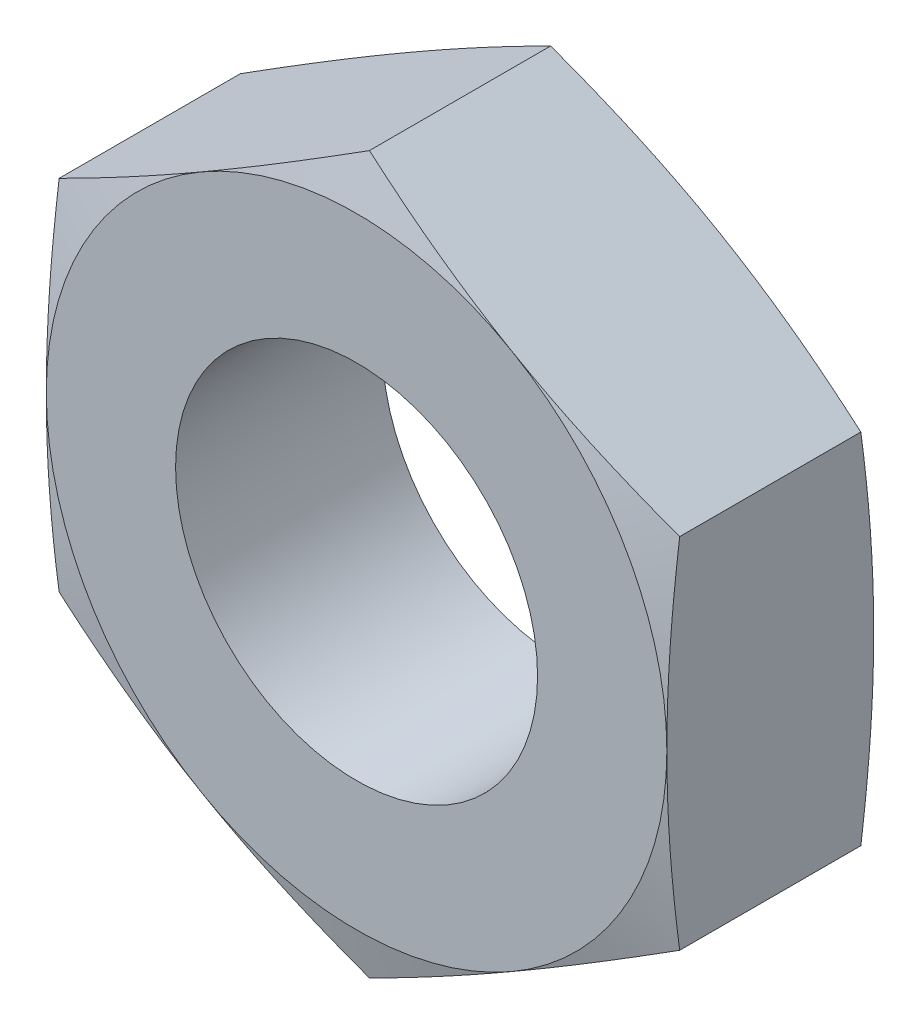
ISO-10303-21;
HEADER;
FILE_DESCRIPTION(('STEP AP214'),'2;1');
FILE_NAME('part.step','',(''),(''),'','','');
FILE_SCHEMA(('AUTOMOTIVE_DESIGN { 1 0 10303 214 1 1 1 1 }'));
ENDSEC;
DATA;
#1=APPLICATION_CONTEXT('core data for automotive mechanical design processes');
#2=APPLICATION_PROTOCOL_DEFINITION('international standard','automotive_design',2000,#1);
#3=PRODUCT_CONTEXT('',#1,'mechanical');
#4=PRODUCT('Part','Part','',(#3));
#5=PRODUCT_RELATED_PRODUCT_CATEGORY('part','',(#4));
#6=PRODUCT_DEFINITION_FORMATION('','',#4);
#7=PRODUCT_DEFINITION_CONTEXT('part definition',#1,'design');
#8=PRODUCT_DEFINITION('design','',#6,#7);
#9=PRODUCT_DEFINITION_SHAPE('','',#8);
#10=(LENGTH_UNIT() NAMED_UNIT(*) SI_UNIT(.MILLI.,.METRE.));
#11=(NAMED_UNIT(*) PLANE_ANGLE_UNIT() SI_UNIT($,.RADIAN.));
#12=(NAMED_UNIT(*) SI_UNIT($,.STERADIAN.) SOLID_ANGLE_UNIT());
#13=UNCERTAINTY_MEASURE_WITH_UNIT(LENGTH_MEASURE(1.E-05),#10,'distance_accuracy_value','');
#14=(GEOMETRIC_REPRESENTATION_CONTEXT(3) GLOBAL_UNCERTAINTY_ASSIGNED_CONTEXT((#13)) GLOBAL_UNIT_ASSIGNED_CONTEXT((#10,
#11,#12)) REPRESENTATION_CONTEXT('',''));
#15=CARTESIAN_POINT('',(0.,0.,0.));
#16=DIRECTION('',(0.,0.,1.));
#17=DIRECTION('',(1.,0.,0.));
#18=AXIS2_PLACEMENT_3D('',#15,#16,#17);
#19=CARTESIAN_POINT('',(0.,17.3205080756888,10.));
#20=DIRECTION('',(0.5,-0.866025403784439,0.));
#21=DIRECTION('',(0.866025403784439,0.5,0.));
#22=AXIS2_PLACEMENT_3D('',#19,#20,#21);
#23=PLANE('',#22);
#24=CARTESIAN_POINT('',(-15.0002,8.66013856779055,0.621809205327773));
#25=CARTESIAN_POINT('',(-14.3772710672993,9.01978675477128,0.525403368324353));
#26=CARTESIAN_POINT('',(-13.7532127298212,9.38008700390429,0.437882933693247));
#27=CARTESIAN_POINT('',(-12.5028922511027,10.1019598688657,0.284117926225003));
#28=CARTESIAN_POINT('',(-11.8766293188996,10.4635329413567,0.217881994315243));
#29=CARTESIAN_POINT('',(-10.6256964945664,11.1857593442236,0.110552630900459));
#30=CARTESIAN_POINT('',(-10.0010350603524,11.5464077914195,0.0693312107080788));
#31=CARTESIAN_POINT('',(-8.7509156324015,12.2681645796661,0.0140575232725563));
#32=CARTESIAN_POINT('',(-8.12545781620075,12.6292728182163,0.));
#33=CARTESIAN_POINT('',(-6.87454218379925,13.3514892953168,0.));
#34=CARTESIAN_POINT('',(-6.2490843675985,13.7125975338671,0.0140575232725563));
#35=CARTESIAN_POINT('',(-4.99896493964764,14.4343543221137,0.069331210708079));
#36=CARTESIAN_POINT('',(-4.37430350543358,14.7950027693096,0.110552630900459));
#37=CARTESIAN_POINT('',(-3.12337068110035,15.5172291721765,0.217881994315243));
#38=CARTESIAN_POINT('',(-2.49710774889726,15.8788022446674,0.284117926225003));
#39=CARTESIAN_POINT('',(-1.24678727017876,16.6006751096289,0.437882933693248));
#40=CARTESIAN_POINT('',(-0.622728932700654,16.9609753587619,0.525403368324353));
#41=CARTESIAN_POINT('',(0.000200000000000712,17.3206235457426,0.621809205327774));
#42=B_SPLINE_CURVE_WITH_KNOTS('',3,(#24,#25,#26,#27,#28,#29,#30,#31,#32,#33,#34,#35,#36,#37,#38,
#39,#40,#41),.UNSPECIFIED.,.F.,.F.,(4,2,2,2,2,2,2,2,4),(0.,2.17729853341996,4.35547987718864,
6.52242029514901,8.68894138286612,10.8554624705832,13.0224028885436,15.2005842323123,
17.3778827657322),.UNSPECIFIED.);
#43=CARTESIAN_POINT('',(-15.,8.66025403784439,0.621778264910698));
#44=VERTEX_POINT('',#43);
#45=CARTESIAN_POINT('',(-7.5,12.9903810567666,0.));
#46=VERTEX_POINT('',#45);
#47=EDGE_CURVE('E125',#44,#46,#42,.T.);
#48=ORIENTED_EDGE('',*,*,#47,.F.);
#49=DIRECTION('',(0.,0.,-1.));
#50=VECTOR('',#49,1.);
#51=CARTESIAN_POINT('',(-15.,8.66025403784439,10.));
#52=LINE('',#51,#50);
#53=CARTESIAN_POINT('',(-15.,8.66025403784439,9.3782217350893));
#54=VERTEX_POINT('',#53);
#55=EDGE_CURVE('E212',#54,#44,#52,.T.);
#56=ORIENTED_EDGE('',*,*,#55,.F.);
#57=CARTESIAN_POINT('',(0.000200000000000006,17.3206235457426,9.37819079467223));
#58=CARTESIAN_POINT('',(-0.622728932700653,16.9609753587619,9.47459663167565));
#59=CARTESIAN_POINT('',(-1.24678727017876,16.6006751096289,9.56211706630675));
#60=CARTESIAN_POINT('',(-2.49710774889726,15.8788022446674,9.715882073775));
#61=CARTESIAN_POINT('',(-3.12337068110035,15.5172291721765,9.78211800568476));
#62=CARTESIAN_POINT('',(-4.37430350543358,14.7950027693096,9.88944736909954));
#63=CARTESIAN_POINT('',(-4.99896493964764,14.4343543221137,9.93066878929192));
#64=CARTESIAN_POINT('',(-6.2490843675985,13.7125975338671,9.98594247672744));
#65=CARTESIAN_POINT('',(-6.87454218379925,13.3514892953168,10.));
#66=CARTESIAN_POINT('',(-8.12545781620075,12.6292728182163,10.));
#67=CARTESIAN_POINT('',(-8.7509156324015,12.2681645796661,9.98594247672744));
#68=CARTESIAN_POINT('',(-10.0010350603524,11.5464077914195,9.93066878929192));
#69=CARTESIAN_POINT('',(-10.6256964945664,11.1857593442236,9.88944736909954));
#70=CARTESIAN_POINT('',(-11.8766293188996,10.4635329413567,9.78211800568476));
#71=CARTESIAN_POINT('',(-12.5028922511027,10.1019598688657,9.715882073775));
#72=CARTESIAN_POINT('',(-13.7532127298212,9.38008700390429,9.56211706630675));
#73=CARTESIAN_POINT('',(-14.3772710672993,9.01978675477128,9.47459663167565));
#74=CARTESIAN_POINT('',(-15.0002,8.66013856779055,9.37819079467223));
#75=B_SPLINE_CURVE_WITH_KNOTS('',3,(#57,#58,#59,#60,#61,#62,#63,#64,#65,#66,#67,#68,#69,#70,#71,
#72,#73,#74),.UNSPECIFIED.,.F.,.F.,(4,2,2,2,2,2,2,2,4),(0.,2.17729853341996,4.35547987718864,
6.52242029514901,8.68894138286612,10.8554624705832,13.0224028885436,15.2005842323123,
17.3778827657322),.UNSPECIFIED.);
#76=CARTESIAN_POINT('',(-7.5,12.9903810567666,10.));
#77=VERTEX_POINT('',#76);
#78=EDGE_CURVE('E234',#77,#54,#75,.T.);
#79=ORIENTED_EDGE('',*,*,#78,.F.);
#80=CARTESIAN_POINT('',(0.,17.3205080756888,9.3782217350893));
#81=VERTEX_POINT('',#80);
#82=EDGE_CURVE('E231',#81,#77,#75,.T.);
#83=ORIENTED_EDGE('',*,*,#82,.F.);
#84=DIRECTION('',(0.,0.,-1.));
#85=VECTOR('',#84,1.);
#86=CARTESIAN_POINT('',(0.,17.3205080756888,10.));
#87=LINE('',#86,#85);
#88=CARTESIAN_POINT('',(0.,17.3205080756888,0.621778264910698));
#89=VERTEX_POINT('',#88);
#90=EDGE_CURVE('E151',#81,#89,#87,.T.);
#91=ORIENTED_EDGE('',*,*,#90,.T.);
#92=EDGE_CURVE('E134',#46,#89,#42,.T.);
#93=ORIENTED_EDGE('',*,*,#92,.F.);
#94=EDGE_LOOP('',(#48,#56,#79,#83,#91,#93));
#95=FACE_BOUND('',#94,.T.);
#96=ADVANCED_FACE('F38',(#95),#23,.F.);
#97=CARTESIAN_POINT('',(-15.,8.66025403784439,10.));
#98=DIRECTION('',(1.,0.,0.));
#99=DIRECTION('',(0.,0.,-1.));
#100=AXIS2_PLACEMENT_3D('',#97,#98,#99);
#101=PLANE('',#100);
#102=CARTESIAN_POINT('',(-15.,-23.2131682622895,3.38630377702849));
#103=CARTESIAN_POINT('',(-15.,-22.5288374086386,3.23233440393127));
#104=CARTESIAN_POINT('',(-15.,-21.8440866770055,3.08019861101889));
#105=CARTESIAN_POINT('',(-15.,-20.4735384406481,2.78058502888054));
#106=CARTESIAN_POINT('',(-15.,-19.7877408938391,2.63310743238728));
#107=CARTESIAN_POINT('',(-15.,-18.4143353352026,2.34368475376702));
#108=CARTESIAN_POINT('',(-15.,-17.7267262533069,2.20174473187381));
#109=CARTESIAN_POINT('',(-15.,-16.3500980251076,1.92487925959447));
#110=CARTESIAN_POINT('',(-15.,-15.6610788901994,1.78995375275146));
#111=CARTESIAN_POINT('',(-15.,-14.2874577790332,1.52994537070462));
#112=CARTESIAN_POINT('',(-15.,-13.6028702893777,1.40478632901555));
#113=CARTESIAN_POINT('',(-15.,-12.2318286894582,1.165061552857));
#114=CARTESIAN_POINT('',(-15.,-11.5453745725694,1.05049585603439));
#115=CARTESIAN_POINT('',(-15.,-10.170443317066,0.834474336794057));
#116=CARTESIAN_POINT('',(-15.,-9.4819663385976,0.733017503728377));
#117=CARTESIAN_POINT('',(-15.,-8.10281343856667,0.546146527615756));
#118=CARTESIAN_POINT('',(-15.,-7.41213751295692,0.460732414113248));
#119=CARTESIAN_POINT('',(-15.,-6.02060687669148,0.308288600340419));
#120=CARTESIAN_POINT('',(-15.,-5.31972713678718,0.241484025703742));
#121=CARTESIAN_POINT('',(-15.,-3.91614186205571,0.130833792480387));
#122=CARTESIAN_POINT('',(-15.,-3.21343636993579,0.0869876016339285));
#123=CARTESIAN_POINT('',(-15.,-1.80725202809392,0.0248063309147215));
#124=CARTESIAN_POINT('',(-15.,-1.10377379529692,0.0064575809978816));
#125=CARTESIAN_POINT('',(-15.,0.30337547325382,-0.00359711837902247));
#126=CARTESIAN_POINT('',(-15.,1.00704650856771,0.00469687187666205));
#127=CARTESIAN_POINT('',(-15.,2.41670242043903,0.0474823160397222));
#128=CARTESIAN_POINT('',(-15.,3.12268369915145,0.0820899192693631));
#129=CARTESIAN_POINT('',(-15.,4.53302706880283,0.175523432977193));
#130=CARTESIAN_POINT('',(-15.,5.23738912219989,0.234349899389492));
#131=CARTESIAN_POINT('',(-15.,6.64451201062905,0.37317514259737));
#132=CARTESIAN_POINT('',(-15.,7.34727129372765,0.453189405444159));
#133=CARTESIAN_POINT('',(-15.,8.75050977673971,0.630966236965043));
#134=CARTESIAN_POINT('',(-15.,9.45098898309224,0.728728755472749));
#135=CARTESIAN_POINT('',(-15.,10.9675253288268,0.956457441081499));
#136=CARTESIAN_POINT('',(-15.,11.7831812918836,1.08907429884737));
#137=CARTESIAN_POINT('',(-15.,13.411851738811,1.36973252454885));
#138=CARTESIAN_POINT('',(-15.,14.2248660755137,1.51777473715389));
#139=CARTESIAN_POINT('',(-15.,15.8487741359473,1.82583201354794));
#140=CARTESIAN_POINT('',(-15.,16.6596674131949,1.98584941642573));
#141=CARTESIAN_POINT('',(-15.,18.2795427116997,2.31515959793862));
#142=CARTESIAN_POINT('',(-15.,19.0885247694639,2.48445219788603));
#143=CARTESIAN_POINT('',(-15.,20.7053727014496,2.83039275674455));
#144=CARTESIAN_POINT('',(-15.,21.5132377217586,3.0070446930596));
#145=CARTESIAN_POINT('',(-15.,23.1276900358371,3.3660924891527));
#146=CARTESIAN_POINT('',(-15.,23.9342773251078,3.54848836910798));
#147=CARTESIAN_POINT('',(-15.,25.5463044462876,3.91784583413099));
#148=CARTESIAN_POINT('',(-15.,26.3517444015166,4.10480688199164));
#149=CARTESIAN_POINT('',(-15.,27.9617531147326,4.48243252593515));
#150=CARTESIAN_POINT('',(-15.,28.7663218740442,4.67309711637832));
#151=CARTESIAN_POINT('',(-15.,30.363210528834,5.05469435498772));
#152=CARTESIAN_POINT('',(-15.,31.1555407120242,5.24558399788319));
#153=CARTESIAN_POINT('',(-15.,32.7396116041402,5.62979499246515));
#154=CARTESIAN_POINT('',(-15.,33.5313523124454,5.82311634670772));
#155=CARTESIAN_POINT('',(-15.,35.9058840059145,6.4061164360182));
#156=CARTESIAN_POINT('',(-15.,37.4879325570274,6.79881871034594));
#157=CARTESIAN_POINT('',(-15.,40.6477168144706,7.58923608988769));
#158=CARTESIAN_POINT('',(-15.,42.2254551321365,7.98694078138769));
#159=CARTESIAN_POINT('',(-15.,44.5912213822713,8.58666010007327));
#160=CARTESIAN_POINT('',(-15.,45.3796518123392,8.78708894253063));
#161=CARTESIAN_POINT('',(-15.,46.9562764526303,9.18887107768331));
#162=CARTESIAN_POINT('',(-15.,47.7444706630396,9.39022436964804));
#163=CARTESIAN_POINT('',(-15.,48.5325634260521,9.59197373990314));
#164=B_SPLINE_CURVE_WITH_KNOTS('',3,(#102,#103,#104,#105,#106,#107,#108,#109,#110,#111,#112,
#113,#114,#115,#116,#117,#118,#119,#120,#121,#122,#123,#124,#125,#126,#127,#128,#129,#130,#131,
#132,#133,#134,#135,#136,#137,#138,#139,#140,#141,#142,#143,#144,#145,#146,#147,#148,#149,#150,
#151,#152,#153,#154,#155,#156,#157,#158,#159,#160,#161,#162,#163),.UNSPECIFIED.,.F.,.F.,(4,2,2,
2,2,2,2,2,2,2,2,2,2,2,2,2,2,2,2,2,2,2,2,2,2,2,2,2,2,2,4),(0.,2.10432223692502,4.20873142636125,
6.31502061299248,8.42129284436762,10.5090298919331,12.5967743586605,14.6843577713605,
16.7719450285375,18.8837865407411,20.9955790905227,23.106238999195,25.2168941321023,
27.3369202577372,29.4569950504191,31.5786236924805,33.700246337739,36.1791488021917,
38.6581870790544,41.1377108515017,43.617186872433,46.0980207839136,48.5788634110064,
51.0594154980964,53.5399638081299,55.9849609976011,58.429960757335,63.320120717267,
68.2013885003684,70.641910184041,73.0824299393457),.UNSPECIFIED.);
#165=CARTESIAN_POINT('',(-15.,-8.66025403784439,0.621778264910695));
#166=VERTEX_POINT('',#165);
#167=CARTESIAN_POINT('',(-15.,0.,0.));
#168=VERTEX_POINT('',#167);
#169=EDGE_CURVE('E261',#166,#168,#164,.T.);
#170=ORIENTED_EDGE('',*,*,#169,.F.);
#171=DIRECTION('',(0.,0.,-1.));
#172=VECTOR('',#171,1.);
#173=CARTESIAN_POINT('',(-15.,-8.66025403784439,10.));
#174=LINE('',#173,#172);
#175=CARTESIAN_POINT('',(-15.,-8.66025403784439,9.3782217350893));
#176=VERTEX_POINT('',#175);
#177=EDGE_CURVE('E214',#176,#166,#174,.T.);
#178=ORIENTED_EDGE('',*,*,#177,.F.);
#179=CARTESIAN_POINT('',(-15.,-23.2131682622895,6.61369622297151));
#180=CARTESIAN_POINT('',(-15.,-22.5288374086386,6.76766559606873));
#181=CARTESIAN_POINT('',(-15.,-21.8440866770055,6.9198013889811));
#182=CARTESIAN_POINT('',(-15.,-20.4735384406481,7.21941497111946));
#183=CARTESIAN_POINT('',(-15.,-19.7877408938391,7.36689256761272));
#184=CARTESIAN_POINT('',(-15.,-18.4143353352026,7.65631524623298));
#185=CARTESIAN_POINT('',(-15.,-17.7267262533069,7.79825526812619));
#186=CARTESIAN_POINT('',(-15.,-16.3500980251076,8.07512074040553));
#187=CARTESIAN_POINT('',(-15.,-15.6610788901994,8.21004624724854));
#188=CARTESIAN_POINT('',(-15.,-14.2874577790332,8.47005462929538));
#189=CARTESIAN_POINT('',(-15.,-13.6028702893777,8.59521367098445));
#190=CARTESIAN_POINT('',(-15.,-12.2318286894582,8.834938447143));
#191=CARTESIAN_POINT('',(-15.,-11.5453745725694,8.94950414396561));
#192=CARTESIAN_POINT('',(-15.,-10.170443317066,9.16552566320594));
#193=CARTESIAN_POINT('',(-15.,-9.48196633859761,9.26698249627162));
#194=CARTESIAN_POINT('',(-15.,-8.10281343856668,9.45385347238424));
#195=CARTESIAN_POINT('',(-15.,-7.41213751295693,9.53926758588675));
#196=CARTESIAN_POINT('',(-15.,-6.02060687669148,9.69171139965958));
#197=CARTESIAN_POINT('',(-15.,-5.31972713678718,9.75851597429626));
#198=CARTESIAN_POINT('',(-15.,-3.9161418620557,9.86916620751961));
#199=CARTESIAN_POINT('',(-15.,-3.21343636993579,9.91301239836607));
#200=CARTESIAN_POINT('',(-15.,-1.80725202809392,9.97519366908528));
#201=CARTESIAN_POINT('',(-15.,-1.10377379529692,9.99354241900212));
#202=CARTESIAN_POINT('',(-15.,0.303375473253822,10.003597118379));
#203=CARTESIAN_POINT('',(-15.,1.00704650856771,9.99530312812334));
#204=CARTESIAN_POINT('',(-15.,2.41670242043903,9.95251768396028));
#205=CARTESIAN_POINT('',(-15.,3.12268369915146,9.91791008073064));
#206=CARTESIAN_POINT('',(-15.,4.53302706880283,9.82447656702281));
#207=CARTESIAN_POINT('',(-15.,5.23738912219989,9.76565010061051));
#208=CARTESIAN_POINT('',(-15.,6.64451201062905,9.62682485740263));
#209=CARTESIAN_POINT('',(-15.,7.34727129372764,9.54681059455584));
#210=CARTESIAN_POINT('',(-15.,8.75050977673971,9.36903376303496));
#211=CARTESIAN_POINT('',(-15.,9.45098898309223,9.27127124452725));
#212=CARTESIAN_POINT('',(-15.,10.9675253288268,9.0435425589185));
#213=CARTESIAN_POINT('',(-15.,11.7831812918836,8.91092570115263));
#214=CARTESIAN_POINT('',(-15.,13.411851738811,8.63026747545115));
#215=CARTESIAN_POINT('',(-15.,14.2248660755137,8.48222526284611));
#216=CARTESIAN_POINT('',(-15.,15.8487741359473,8.17416798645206));
#217=CARTESIAN_POINT('',(-15.,16.6596674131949,8.01415058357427));
#218=CARTESIAN_POINT('',(-15.,18.2795427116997,7.68484040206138));
#219=CARTESIAN_POINT('',(-15.,19.0885247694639,7.51554780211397));
#220=CARTESIAN_POINT('',(-15.,20.7053727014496,7.16960724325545));
#221=CARTESIAN_POINT('',(-15.,21.5132377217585,6.9929553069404));
#222=CARTESIAN_POINT('',(-15.,23.127690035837,6.63390751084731));
#223=CARTESIAN_POINT('',(-15.,23.9342773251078,6.45151163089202));
#224=CARTESIAN_POINT('',(-15.,25.5463044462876,6.08215416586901));
#225=CARTESIAN_POINT('',(-15.,26.3517444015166,5.89519311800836));
#226=CARTESIAN_POINT('',(-15.,27.9617531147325,5.51756747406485));
#227=CARTESIAN_POINT('',(-15.,28.7663218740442,5.32690288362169));
#228=CARTESIAN_POINT('',(-15.,30.363210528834,4.94530564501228));
#229=CARTESIAN_POINT('',(-15.,31.1555407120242,4.75441600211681));
#230=CARTESIAN_POINT('',(-15.,32.7396116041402,4.37020500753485));
#231=CARTESIAN_POINT('',(-15.,33.5313523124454,4.17688365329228));
#232=CARTESIAN_POINT('',(-15.,35.9058840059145,3.5938835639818));
#233=CARTESIAN_POINT('',(-15.,37.4879325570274,3.20118128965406));
#234=CARTESIAN_POINT('',(-15.,40.6477168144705,2.41076391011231));
#235=CARTESIAN_POINT('',(-15.,42.2254551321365,2.01305921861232));
#236=CARTESIAN_POINT('',(-15.,44.5912213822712,1.41333989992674));
#237=CARTESIAN_POINT('',(-15.,45.3796518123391,1.21291105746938));
#238=CARTESIAN_POINT('',(-15.,46.9562764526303,0.8111289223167));
#239=CARTESIAN_POINT('',(-15.,47.7444706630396,0.609775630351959));
#240=CARTESIAN_POINT('',(-15.,48.5325634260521,0.408026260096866));
#241=B_SPLINE_CURVE_WITH_KNOTS('',3,(#179,#180,#181,#182,#183,#184,#185,#186,#187,#188,#189,
#190,#191,#192,#193,#194,#195,#196,#197,#198,#199,#200,#201,#202,#203,#204,#205,#206,#207,#208,
#209,#210,#211,#212,#213,#214,#215,#216,#217,#218,#219,#220,#221,#222,#223,#224,#225,#226,#227,
#228,#229,#230,#231,#232,#233,#234,#235,#236,#237,#238,#239,#240),.UNSPECIFIED.,.F.,.F.,(4,2,2,
2,2,2,2,2,2,2,2,2,2,2,2,2,2,2,2,2,2,2,2,2,2,2,2,2,2,2,4),(0.,2.10432223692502,4.20873142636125,
6.31502061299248,8.42129284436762,10.5090298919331,12.5967743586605,14.6843577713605,
16.7719450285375,18.8837865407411,20.9955790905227,23.106238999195,25.2168941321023,
27.3369202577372,29.4569950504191,31.5786236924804,33.700246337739,36.1791488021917,
38.6581870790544,41.1377108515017,43.617186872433,46.0980207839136,48.5788634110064,
51.0594154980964,53.5399638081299,55.9849609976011,58.429960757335,63.320120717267,
68.2013885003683,70.6419101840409,73.0824299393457),.UNSPECIFIED.);
#242=CARTESIAN_POINT('',(-15.,0.,10.));
#243=VERTEX_POINT('',#242);
#244=EDGE_CURVE('E240',#243,#176,#241,.F.);
#245=ORIENTED_EDGE('',*,*,#244,.F.);
#246=EDGE_CURVE('E239',#54,#243,#241,.F.);
#247=ORIENTED_EDGE('',*,*,#246,.F.);
#248=ORIENTED_EDGE('',*,*,#55,.T.);
#249=EDGE_CURVE('E128',#168,#44,#164,.T.);
#250=ORIENTED_EDGE('',*,*,#249,.F.);
#251=EDGE_LOOP('',(#170,#178,#245,#247,#248,#250));
#252=FACE_BOUND('',#251,.T.);
#253=ADVANCED_FACE('F251',(#252),#101,.F.);
#254=CARTESIAN_POINT('',(0.,-17.3205080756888,10.));
#255=DIRECTION('',(0.5,0.866025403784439,0.));
#256=DIRECTION('',(-0.866025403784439,0.5,0.));
#257=AXIS2_PLACEMENT_3D('',#254,#255,#256);
#258=PLANE('',#257);
#259=CARTESIAN_POINT('',(0.000200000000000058,-17.3206235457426,0.621809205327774));
#260=CARTESIAN_POINT('',(-0.622728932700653,-16.9609753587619,0.525403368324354));
#261=CARTESIAN_POINT('',(-1.24678727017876,-16.6006751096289,0.437882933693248));
#262=CARTESIAN_POINT('',(-2.49710774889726,-15.8788022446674,0.284117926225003));
#263=CARTESIAN_POINT('',(-3.12337068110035,-15.5172291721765,0.217881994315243));
#264=CARTESIAN_POINT('',(-4.37430350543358,-14.7950027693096,0.11055263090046));
#265=CARTESIAN_POINT('',(-4.99896493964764,-14.4343543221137,0.0693312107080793));
#266=CARTESIAN_POINT('',(-6.2490843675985,-13.7125975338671,0.0140575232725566));
#267=CARTESIAN_POINT('',(-6.87454218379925,-13.3514892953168,0.));
#268=CARTESIAN_POINT('',(-8.12545781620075,-12.6292728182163,0.));
#269=CARTESIAN_POINT('',(-8.7509156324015,-12.2681645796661,0.0140575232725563));
#270=CARTESIAN_POINT('',(-10.0010350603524,-11.5464077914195,0.0693312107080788));
#271=CARTESIAN_POINT('',(-10.6256964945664,-11.1857593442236,0.110552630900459));
#272=CARTESIAN_POINT('',(-11.8766293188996,-10.4635329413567,0.217881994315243));
#273=CARTESIAN_POINT('',(-12.5028922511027,-10.1019598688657,0.284117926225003));
#274=CARTESIAN_POINT('',(-13.7532127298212,-9.38008700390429,0.437882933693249));
#275=CARTESIAN_POINT('',(-14.3772710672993,-9.01978675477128,0.525403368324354));
#276=CARTESIAN_POINT('',(-15.0002,-8.66013856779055,0.621809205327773));
#277=B_SPLINE_CURVE_WITH_KNOTS('',3,(#259,#260,#261,#262,#263,#264,#265,#266,#267,#268,#269,
#270,#271,#272,#273,#274,#275,#276),.UNSPECIFIED.,.F.,.F.,(4,2,2,2,2,2,2,2,4),(0.,
2.17729853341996,4.35547987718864,6.52242029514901,8.68894138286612,10.8554624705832,
13.0224028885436,15.2005842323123,17.3778827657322),.UNSPECIFIED.);
#278=CARTESIAN_POINT('',(0.,-17.3205080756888,0.621778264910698));
#279=VERTEX_POINT('',#278);
#280=CARTESIAN_POINT('',(-7.5,-12.9903810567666,0.));
#281=VERTEX_POINT('',#280);
#282=EDGE_CURVE('E269',#279,#281,#277,.T.);
#283=ORIENTED_EDGE('',*,*,#282,.F.);
#284=DIRECTION('',(0.,0.,-1.));
#285=VECTOR('',#284,1.);
#286=CARTESIAN_POINT('',(0.,-17.3205080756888,10.));
#287=LINE('',#286,#285);
#288=CARTESIAN_POINT('',(0.,-17.3205080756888,9.3782217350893));
#289=VERTEX_POINT('',#288);
#290=EDGE_CURVE('E217',#289,#279,#287,.T.);
#291=ORIENTED_EDGE('',*,*,#290,.F.);
#292=CARTESIAN_POINT('',(-15.0002,-8.66013856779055,9.37819079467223));
#293=CARTESIAN_POINT('',(-14.3772710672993,-9.01978675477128,9.47459663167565));
#294=CARTESIAN_POINT('',(-13.7532127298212,-9.38008700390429,9.56211706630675));
#295=CARTESIAN_POINT('',(-12.5028922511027,-10.1019598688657,9.715882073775));
#296=CARTESIAN_POINT('',(-11.8766293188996,-10.4635329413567,9.78211800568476));
#297=CARTESIAN_POINT('',(-10.6256964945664,-11.1857593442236,9.88944736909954));
#298=CARTESIAN_POINT('',(-10.0010350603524,-11.5464077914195,9.93066878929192));
#299=CARTESIAN_POINT('',(-8.7509156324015,-12.2681645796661,9.98594247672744));
#300=CARTESIAN_POINT('',(-8.12545781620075,-12.6292728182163,10.));
#301=CARTESIAN_POINT('',(-6.87454218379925,-13.3514892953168,10.));
#302=CARTESIAN_POINT('',(-6.2490843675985,-13.7125975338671,9.98594247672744));
#303=CARTESIAN_POINT('',(-4.99896493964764,-14.4343543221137,9.93066878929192));
#304=CARTESIAN_POINT('',(-4.37430350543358,-14.7950027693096,9.88944736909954));
#305=CARTESIAN_POINT('',(-3.12337068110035,-15.5172291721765,9.78211800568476));
#306=CARTESIAN_POINT('',(-2.49710774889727,-15.8788022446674,9.715882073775));
#307=CARTESIAN_POINT('',(-1.24678727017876,-16.6006751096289,9.56211706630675));
#308=CARTESIAN_POINT('',(-0.622728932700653,-16.9609753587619,9.47459663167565));
#309=CARTESIAN_POINT('',(0.000200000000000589,-17.3206235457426,9.37819079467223));
#310=B_SPLINE_CURVE_WITH_KNOTS('',3,(#292,#293,#294,#295,#296,#297,#298,#299,#300,#301,#302,
#303,#304,#305,#306,#307,#308,#309),.UNSPECIFIED.,.F.,.F.,(4,2,2,2,2,2,2,2,4),(0.,
2.17729853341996,4.35547987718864,6.52242029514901,8.68894138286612,10.8554624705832,
13.0224028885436,15.2005842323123,17.3778827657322),.UNSPECIFIED.);
#311=CARTESIAN_POINT('',(-7.5,-12.9903810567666,10.));
#312=VERTEX_POINT('',#311);
#313=EDGE_CURVE('E246',#312,#289,#310,.T.);
#314=ORIENTED_EDGE('',*,*,#313,.F.);
#315=EDGE_CURVE('E245',#176,#312,#310,.T.);
#316=ORIENTED_EDGE('',*,*,#315,.F.);
#317=ORIENTED_EDGE('',*,*,#177,.T.);
#318=EDGE_CURVE('E184',#281,#166,#277,.T.);
#319=ORIENTED_EDGE('',*,*,#318,.F.);
#320=EDGE_LOOP('',(#283,#291,#314,#316,#317,#319));
#321=FACE_BOUND('',#320,.T.);
#322=ADVANCED_FACE('F254',(#321),#258,.F.);
#323=CARTESIAN_POINT('',(0.,-17.3205080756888,10.));
#324=DIRECTION('',(-0.5,0.866025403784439,0.));
#325=DIRECTION('',(-0.866025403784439,-0.5,0.));
#326=AXIS2_PLACEMENT_3D('',#323,#324,#325);
#327=PLANE('',#326);
#328=CARTESIAN_POINT('',(15.0002,-8.66013856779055,0.621809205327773));
#329=CARTESIAN_POINT('',(14.3772710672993,-9.01978675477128,0.525403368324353));
#330=CARTESIAN_POINT('',(13.7532127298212,-9.38008700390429,0.437882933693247));
#331=CARTESIAN_POINT('',(12.5028922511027,-10.1019598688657,0.284117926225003));
#332=CARTESIAN_POINT('',(11.8766293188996,-10.4635329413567,0.217881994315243));
#333=CARTESIAN_POINT('',(10.6256964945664,-11.1857593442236,0.110552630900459));
#334=CARTESIAN_POINT('',(10.0010350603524,-11.5464077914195,0.0693312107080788));
#335=CARTESIAN_POINT('',(8.7509156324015,-12.2681645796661,0.0140575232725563));
#336=CARTESIAN_POINT('',(8.12545781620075,-12.6292728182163,0.));
#337=CARTESIAN_POINT('',(6.87454218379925,-13.3514892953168,0.));
#338=CARTESIAN_POINT('',(6.2490843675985,-13.7125975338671,0.0140575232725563));
#339=CARTESIAN_POINT('',(4.99896493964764,-14.4343543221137,0.069331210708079));
#340=CARTESIAN_POINT('',(4.37430350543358,-14.7950027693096,0.110552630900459));
#341=CARTESIAN_POINT('',(3.12337068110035,-15.5172291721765,0.217881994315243));
#342=CARTESIAN_POINT('',(2.49710774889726,-15.8788022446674,0.284117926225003));
#343=CARTESIAN_POINT('',(1.24678727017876,-16.6006751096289,0.437882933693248));
#344=CARTESIAN_POINT('',(0.622728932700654,-16.9609753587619,0.525403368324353));
#345=CARTESIAN_POINT('',(-0.000200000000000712,-17.3206235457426,0.621809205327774));
#346=B_SPLINE_CURVE_WITH_KNOTS('',3,(#328,#329,#330,#331,#332,#333,#334,#335,#336,#337,#338,
#339,#340,#341,#342,#343,#344,#345),.UNSPECIFIED.,.F.,.F.,(4,2,2,2,2,2,2,2,4),(0.,
2.17729853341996,4.35547987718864,6.52242029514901,8.68894138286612,10.8554624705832,
13.0224028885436,15.2005842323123,17.3778827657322),.UNSPECIFIED.);
#347=CARTESIAN_POINT('',(15.,-8.66025403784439,0.621778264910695));
#348=VERTEX_POINT('',#347);
#349=CARTESIAN_POINT('',(7.5,-12.9903810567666,0.));
#350=VERTEX_POINT('',#349);
#351=EDGE_CURVE('E164',#348,#350,#346,.T.);
#352=ORIENTED_EDGE('',*,*,#351,.F.);
#353=DIRECTION('',(0.,0.,-1.));
#354=VECTOR('',#353,1.);
#355=CARTESIAN_POINT('',(15.,-8.66025403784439,10.));
#356=LINE('',#355,#354);
#357=CARTESIAN_POINT('',(15.,-8.66025403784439,9.3782217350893));
#358=VERTEX_POINT('',#357);
#359=EDGE_CURVE('E220',#358,#348,#356,.T.);
#360=ORIENTED_EDGE('',*,*,#359,.F.);
#361=CARTESIAN_POINT('',(-0.000200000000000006,-17.3206235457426,9.37819079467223));
#362=CARTESIAN_POINT('',(0.622728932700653,-16.9609753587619,9.47459663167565));
#363=CARTESIAN_POINT('',(1.24678727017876,-16.6006751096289,9.56211706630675));
#364=CARTESIAN_POINT('',(2.49710774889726,-15.8788022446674,9.715882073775));
#365=CARTESIAN_POINT('',(3.12337068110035,-15.5172291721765,9.78211800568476));
#366=CARTESIAN_POINT('',(4.37430350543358,-14.7950027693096,9.88944736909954));
#367=CARTESIAN_POINT('',(4.99896493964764,-14.4343543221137,9.93066878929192));
#368=CARTESIAN_POINT('',(6.2490843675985,-13.7125975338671,9.98594247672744));
#369=CARTESIAN_POINT('',(6.87454218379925,-13.3514892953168,10.));
#370=CARTESIAN_POINT('',(8.12545781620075,-12.6292728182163,10.));
#371=CARTESIAN_POINT('',(8.7509156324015,-12.2681645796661,9.98594247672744));
#372=CARTESIAN_POINT('',(10.0010350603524,-11.5464077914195,9.93066878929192));
#373=CARTESIAN_POINT('',(10.6256964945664,-11.1857593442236,9.88944736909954));
#374=CARTESIAN_POINT('',(11.8766293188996,-10.4635329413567,9.78211800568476));
#375=CARTESIAN_POINT('',(12.5028922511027,-10.1019598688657,9.715882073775));
#376=CARTESIAN_POINT('',(13.7532127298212,-9.38008700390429,9.56211706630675));
#377=CARTESIAN_POINT('',(14.3772710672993,-9.01978675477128,9.47459663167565));
#378=CARTESIAN_POINT('',(15.0002,-8.66013856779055,9.37819079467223));
#379=B_SPLINE_CURVE_WITH_KNOTS('',3,(#361,#362,#363,#364,#365,#366,#367,#368,#369,#370,#371,
#372,#373,#374,#375,#376,#377,#378),.UNSPECIFIED.,.F.,.F.,(4,2,2,2,2,2,2,2,4),(0.,
2.17729853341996,4.35547987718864,6.52242029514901,8.68894138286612,10.8554624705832,
13.0224028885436,15.2005842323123,17.3778827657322),.UNSPECIFIED.);
#380=CARTESIAN_POINT('',(7.5,-12.9903810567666,10.));
#381=VERTEX_POINT('',#380);
#382=EDGE_CURVE('E310',#381,#358,#379,.T.);
#383=ORIENTED_EDGE('',*,*,#382,.F.);
#384=EDGE_CURVE('E306',#289,#381,#379,.T.);
#385=ORIENTED_EDGE('',*,*,#384,.F.);
#386=ORIENTED_EDGE('',*,*,#290,.T.);
#387=EDGE_CURVE('E262',#350,#279,#346,.T.);
#388=ORIENTED_EDGE('',*,*,#387,.F.);
#389=EDGE_LOOP('',(#352,#360,#383,#385,#386,#388));
#390=FACE_BOUND('',#389,.T.);
#391=ADVANCED_FACE('F318',(#390),#327,.F.);
#392=CARTESIAN_POINT('',(15.,8.66025403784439,10.));
#393=DIRECTION('',(-1.,0.,0.));
#394=DIRECTION('',(0.,0.,1.));
#395=AXIS2_PLACEMENT_3D('',#392,#393,#394);
#396=PLANE('',#395);
#397=CARTESIAN_POINT('',(15.,-23.2131682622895,3.38630377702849));
#398=CARTESIAN_POINT('',(15.,-22.5288374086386,3.23233440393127));
#399=CARTESIAN_POINT('',(15.,-21.8440866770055,3.08019861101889));
#400=CARTESIAN_POINT('',(15.,-20.4735384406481,2.78058502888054));
#401=CARTESIAN_POINT('',(15.,-19.7877408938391,2.63310743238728));
#402=CARTESIAN_POINT('',(15.,-18.4143353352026,2.34368475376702));
#403=CARTESIAN_POINT('',(15.,-17.7267262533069,2.20174473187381));
#404=CARTESIAN_POINT('',(15.,-16.3500980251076,1.92487925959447));
#405=CARTESIAN_POINT('',(15.,-15.6610788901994,1.78995375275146));
#406=CARTESIAN_POINT('',(15.,-14.2874577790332,1.52994537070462));
#407=CARTESIAN_POINT('',(15.,-13.6028702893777,1.40478632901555));
#408=CARTESIAN_POINT('',(15.,-12.2318286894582,1.165061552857));
#409=CARTESIAN_POINT('',(15.,-11.5453745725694,1.05049585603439));
#410=CARTESIAN_POINT('',(15.,-10.170443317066,0.834474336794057));
#411=CARTESIAN_POINT('',(15.,-9.4819663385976,0.733017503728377));
#412=CARTESIAN_POINT('',(15.,-8.10281343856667,0.546146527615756));
#413=CARTESIAN_POINT('',(15.,-7.41213751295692,0.460732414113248));
#414=CARTESIAN_POINT('',(15.,-6.02060687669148,0.308288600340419));
#415=CARTESIAN_POINT('',(15.,-5.31972713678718,0.241484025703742));
#416=CARTESIAN_POINT('',(15.,-3.91614186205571,0.130833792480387));
#417=CARTESIAN_POINT('',(15.,-3.21343636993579,0.0869876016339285));
#418=CARTESIAN_POINT('',(15.,-1.80725202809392,0.0248063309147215));
#419=CARTESIAN_POINT('',(15.,-1.10377379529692,0.0064575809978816));
#420=CARTESIAN_POINT('',(15.,0.30337547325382,-0.00359711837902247));
#421=CARTESIAN_POINT('',(15.,1.00704650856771,0.00469687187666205));
#422=CARTESIAN_POINT('',(15.,2.41670242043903,0.0474823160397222));
#423=CARTESIAN_POINT('',(15.,3.12268369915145,0.0820899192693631));
#424=CARTESIAN_POINT('',(15.,4.53302706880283,0.175523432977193));
#425=CARTESIAN_POINT('',(15.,5.23738912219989,0.234349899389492));
#426=CARTESIAN_POINT('',(15.,6.64451201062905,0.37317514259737));
#427=CARTESIAN_POINT('',(15.,7.34727129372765,0.453189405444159));
#428=CARTESIAN_POINT('',(15.,8.75050977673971,0.630966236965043));
#429=CARTESIAN_POINT('',(15.,9.45098898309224,0.728728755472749));
#430=CARTESIAN_POINT('',(15.,10.9675253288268,0.956457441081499));
#431=CARTESIAN_POINT('',(15.,11.7831812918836,1.08907429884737));
#432=CARTESIAN_POINT('',(15.,13.411851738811,1.36973252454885));
#433=CARTESIAN_POINT('',(15.,14.2248660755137,1.51777473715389));
#434=CARTESIAN_POINT('',(15.,15.8487741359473,1.82583201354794));
#435=CARTESIAN_POINT('',(15.,16.6596674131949,1.98584941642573));
#436=CARTESIAN_POINT('',(15.,18.2795427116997,2.31515959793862));
#437=CARTESIAN_POINT('',(15.,19.0885247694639,2.48445219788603));
#438=CARTESIAN_POINT('',(15.,20.7053727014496,2.83039275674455));
#439=CARTESIAN_POINT('',(15.,21.5132377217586,3.0070446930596));
#440=CARTESIAN_POINT('',(15.,23.1276900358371,3.3660924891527));
#441=CARTESIAN_POINT('',(15.,23.9342773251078,3.54848836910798));
#442=CARTESIAN_POINT('',(15.,25.5463044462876,3.91784583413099));
#443=CARTESIAN_POINT('',(15.,26.3517444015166,4.10480688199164));
#444=CARTESIAN_POINT('',(15.,27.9617531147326,4.48243252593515));
#445=CARTESIAN_POINT('',(15.,28.7663218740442,4.67309711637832));
#446=CARTESIAN_POINT('',(15.,30.363210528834,5.05469435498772));
#447=CARTESIAN_POINT('',(15.,31.1555407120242,5.24558399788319));
#448=CARTESIAN_POINT('',(15.,32.7396116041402,5.62979499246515));
#449=CARTESIAN_POINT('',(15.,33.5313523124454,5.82311634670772));
#450=CARTESIAN_POINT('',(15.,35.9058840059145,6.4061164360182));
#451=CARTESIAN_POINT('',(15.,37.4879325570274,6.79881871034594));
#452=CARTESIAN_POINT('',(15.,40.6477168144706,7.58923608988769));
#453=CARTESIAN_POINT('',(15.,42.2254551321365,7.98694078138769));
#454=CARTESIAN_POINT('',(15.,44.5912213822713,8.58666010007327));
#455=CARTESIAN_POINT('',(15.,45.3796518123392,8.78708894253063));
#456=CARTESIAN_POINT('',(15.,46.9562764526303,9.18887107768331));
#457=CARTESIAN_POINT('',(15.,47.7444706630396,9.39022436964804));
#458=CARTESIAN_POINT('',(15.,48.5325634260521,9.59197373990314));
#459=B_SPLINE_CURVE_WITH_KNOTS('',3,(#397,#398,#399,#400,#401,#402,#403,#404,#405,#406,#407,
#408,#409,#410,#411,#412,#413,#414,#415,#416,#417,#418,#419,#420,#421,#422,#423,#424,#425,#426,
#427,#428,#429,#430,#431,#432,#433,#434,#435,#436,#437,#438,#439,#440,#441,#442,#443,#444,#445,
#446,#447,#448,#449,#450,#451,#452,#453,#454,#455,#456,#457,#458),.UNSPECIFIED.,.F.,.F.,(4,2,2,
2,2,2,2,2,2,2,2,2,2,2,2,2,2,2,2,2,2,2,2,2,2,2,2,2,2,2,4),(0.,2.10432223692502,4.20873142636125,
6.31502061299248,8.42129284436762,10.5090298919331,12.5967743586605,14.6843577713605,
16.7719450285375,18.8837865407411,20.9955790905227,23.106238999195,25.2168941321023,
27.3369202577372,29.4569950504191,31.5786236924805,33.700246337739,36.1791488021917,
38.6581870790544,41.1377108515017,43.617186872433,46.0980207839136,48.5788634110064,
51.0594154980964,53.5399638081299,55.9849609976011,58.429960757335,63.320120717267,
68.2013885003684,70.641910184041,73.0824299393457),.UNSPECIFIED.);
#460=CARTESIAN_POINT('',(15.,8.66025403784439,0.621778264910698));
#461=VERTEX_POINT('',#460);
#462=CARTESIAN_POINT('',(15.,0.,0.));
#463=VERTEX_POINT('',#462);
#464=EDGE_CURVE('E152',#461,#463,#459,.F.);
#465=ORIENTED_EDGE('',*,*,#464,.F.);
#466=DIRECTION('',(0.,0.,-1.));
#467=VECTOR('',#466,1.);
#468=CARTESIAN_POINT('',(15.,8.66025403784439,10.));
#469=LINE('',#468,#467);
#470=CARTESIAN_POINT('',(15.,8.66025403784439,9.3782217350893));
#471=VERTEX_POINT('',#470);
#472=EDGE_CURVE('E223',#471,#461,#469,.T.);
#473=ORIENTED_EDGE('',*,*,#472,.F.);
#474=CARTESIAN_POINT('',(15.,-23.2131682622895,6.61369622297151));
#475=CARTESIAN_POINT('',(15.,-22.5288374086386,6.76766559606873));
#476=CARTESIAN_POINT('',(15.,-21.8440866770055,6.9198013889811));
#477=CARTESIAN_POINT('',(15.,-20.4735384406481,7.21941497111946));
#478=CARTESIAN_POINT('',(15.,-19.7877408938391,7.36689256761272));
#479=CARTESIAN_POINT('',(15.,-18.4143353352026,7.65631524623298));
#480=CARTESIAN_POINT('',(15.,-17.7267262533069,7.79825526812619));
#481=CARTESIAN_POINT('',(15.,-16.3500980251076,8.07512074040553));
#482=CARTESIAN_POINT('',(15.,-15.6610788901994,8.21004624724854));
#483=CARTESIAN_POINT('',(15.,-14.2874577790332,8.47005462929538));
#484=CARTESIAN_POINT('',(15.,-13.6028702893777,8.59521367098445));
#485=CARTESIAN_POINT('',(15.,-12.2318286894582,8.834938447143));
#486=CARTESIAN_POINT('',(15.,-11.5453745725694,8.94950414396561));
#487=CARTESIAN_POINT('',(15.,-10.170443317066,9.16552566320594));
#488=CARTESIAN_POINT('',(15.,-9.48196633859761,9.26698249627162));
#489=CARTESIAN_POINT('',(15.,-8.10281343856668,9.45385347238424));
#490=CARTESIAN_POINT('',(15.,-7.41213751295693,9.53926758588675));
#491=CARTESIAN_POINT('',(15.,-6.02060687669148,9.69171139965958));
#492=CARTESIAN_POINT('',(15.,-5.31972713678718,9.75851597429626));
#493=CARTESIAN_POINT('',(15.,-3.9161418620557,9.86916620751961));
#494=CARTESIAN_POINT('',(15.,-3.21343636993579,9.91301239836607));
#495=CARTESIAN_POINT('',(15.,-1.80725202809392,9.97519366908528));
#496=CARTESIAN_POINT('',(15.,-1.10377379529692,9.99354241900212));
#497=CARTESIAN_POINT('',(15.,0.303375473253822,10.003597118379));
#498=CARTESIAN_POINT('',(15.,1.00704650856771,9.99530312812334));
#499=CARTESIAN_POINT('',(15.,2.41670242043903,9.95251768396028));
#500=CARTESIAN_POINT('',(15.,3.12268369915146,9.91791008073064));
#501=CARTESIAN_POINT('',(15.,4.53302706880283,9.82447656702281));
#502=CARTESIAN_POINT('',(15.,5.23738912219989,9.76565010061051));
#503=CARTESIAN_POINT('',(15.,6.64451201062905,9.62682485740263));
#504=CARTESIAN_POINT('',(15.,7.34727129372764,9.54681059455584));
#505=CARTESIAN_POINT('',(15.,8.75050977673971,9.36903376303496));
#506=CARTESIAN_POINT('',(15.,9.45098898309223,9.27127124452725));
#507=CARTESIAN_POINT('',(15.,10.9675253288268,9.0435425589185));
#508=CARTESIAN_POINT('',(15.,11.7831812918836,8.91092570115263));
#509=CARTESIAN_POINT('',(15.,13.411851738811,8.63026747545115));
#510=CARTESIAN_POINT('',(15.,14.2248660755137,8.48222526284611));
#511=CARTESIAN_POINT('',(15.,15.8487741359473,8.17416798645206));
#512=CARTESIAN_POINT('',(15.,16.6596674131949,8.01415058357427));
#513=CARTESIAN_POINT('',(15.,18.2795427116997,7.68484040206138));
#514=CARTESIAN_POINT('',(15.,19.0885247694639,7.51554780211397));
#515=CARTESIAN_POINT('',(15.,20.7053727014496,7.16960724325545));
#516=CARTESIAN_POINT('',(15.,21.5132377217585,6.9929553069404));
#517=CARTESIAN_POINT('',(15.,23.127690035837,6.63390751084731));
#518=CARTESIAN_POINT('',(15.,23.9342773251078,6.45151163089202));
#519=CARTESIAN_POINT('',(15.,25.5463044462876,6.08215416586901));
#520=CARTESIAN_POINT('',(15.,26.3517444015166,5.89519311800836));
#521=CARTESIAN_POINT('',(15.,27.9617531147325,5.51756747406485));
#522=CARTESIAN_POINT('',(15.,28.7663218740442,5.32690288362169));
#523=CARTESIAN_POINT('',(15.,30.363210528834,4.94530564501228));
#524=CARTESIAN_POINT('',(15.,31.1555407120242,4.75441600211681));
#525=CARTESIAN_POINT('',(15.,32.7396116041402,4.37020500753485));
#526=CARTESIAN_POINT('',(15.,33.5313523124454,4.17688365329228));
#527=CARTESIAN_POINT('',(15.,35.9058840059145,3.5938835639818));
#528=CARTESIAN_POINT('',(15.,37.4879325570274,3.20118128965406));
#529=CARTESIAN_POINT('',(15.,40.6477168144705,2.41076391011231));
#530=CARTESIAN_POINT('',(15.,42.2254551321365,2.01305921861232));
#531=CARTESIAN_POINT('',(15.,44.5912213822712,1.41333989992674));
#532=CARTESIAN_POINT('',(15.,45.3796518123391,1.21291105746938));
#533=CARTESIAN_POINT('',(15.,46.9562764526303,0.8111289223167));
#534=CARTESIAN_POINT('',(15.,47.7444706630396,0.609775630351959));
#535=CARTESIAN_POINT('',(15.,48.5325634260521,0.408026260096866));
#536=B_SPLINE_CURVE_WITH_KNOTS('',3,(#474,#475,#476,#477,#478,#479,#480,#481,#482,#483,#484,
#485,#486,#487,#488,#489,#490,#491,#492,#493,#494,#495,#496,#497,#498,#499,#500,#501,#502,#503,
#504,#505,#506,#507,#508,#509,#510,#511,#512,#513,#514,#515,#516,#517,#518,#519,#520,#521,#522,
#523,#524,#525,#526,#527,#528,#529,#530,#531,#532,#533,#534,#535),.UNSPECIFIED.,.F.,.F.,(4,2,2,
2,2,2,2,2,2,2,2,2,2,2,2,2,2,2,2,2,2,2,2,2,2,2,2,2,2,2,4),(0.,2.10432223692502,4.20873142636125,
6.31502061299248,8.42129284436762,10.5090298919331,12.5967743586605,14.6843577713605,
16.7719450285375,18.8837865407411,20.9955790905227,23.106238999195,25.2168941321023,
27.3369202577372,29.4569950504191,31.5786236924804,33.700246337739,36.1791488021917,
38.6581870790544,41.1377108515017,43.617186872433,46.0980207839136,48.5788634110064,
51.0594154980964,53.5399638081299,55.9849609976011,58.429960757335,63.320120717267,
68.2013885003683,70.6419101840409,73.0824299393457),.UNSPECIFIED.);
#537=CARTESIAN_POINT('',(15.,0.,10.));
#538=VERTEX_POINT('',#537);
#539=EDGE_CURVE('E282',#538,#471,#536,.T.);
#540=ORIENTED_EDGE('',*,*,#539,.F.);
#541=EDGE_CURVE('E285',#358,#538,#536,.T.);
#542=ORIENTED_EDGE('',*,*,#541,.F.);
#543=ORIENTED_EDGE('',*,*,#359,.T.);
#544=EDGE_CURVE('E133',#463,#348,#459,.F.);
#545=ORIENTED_EDGE('',*,*,#544,.F.);
#546=EDGE_LOOP('',(#465,#473,#540,#542,#543,#545));
#547=FACE_BOUND('',#546,.T.);
#548=ADVANCED_FACE('F201',(#547),#396,.F.);
#549=CARTESIAN_POINT('',(0.,17.3205080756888,10.));
#550=DIRECTION('',(-0.5,-0.866025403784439,0.));
#551=DIRECTION('',(0.866025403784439,-0.5,0.));
#552=AXIS2_PLACEMENT_3D('',#549,#550,#551);
#553=PLANE('',#552);
#554=CARTESIAN_POINT('',(-0.000200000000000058,17.3206235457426,0.621809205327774));
#555=CARTESIAN_POINT('',(0.622728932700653,16.9609753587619,0.525403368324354));
#556=CARTESIAN_POINT('',(1.24678727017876,16.6006751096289,0.437882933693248));
#557=CARTESIAN_POINT('',(2.49710774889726,15.8788022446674,0.284117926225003));
#558=CARTESIAN_POINT('',(3.12337068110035,15.5172291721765,0.217881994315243));
#559=CARTESIAN_POINT('',(4.37430350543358,14.7950027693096,0.11055263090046));
#560=CARTESIAN_POINT('',(4.99896493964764,14.4343543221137,0.0693312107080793));
#561=CARTESIAN_POINT('',(6.2490843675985,13.7125975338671,0.0140575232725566));
#562=CARTESIAN_POINT('',(6.87454218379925,13.3514892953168,0.));
#563=CARTESIAN_POINT('',(8.12545781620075,12.6292728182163,0.));
#564=CARTESIAN_POINT('',(8.7509156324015,12.2681645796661,0.0140575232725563));
#565=CARTESIAN_POINT('',(10.0010350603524,11.5464077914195,0.0693312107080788));
#566=CARTESIAN_POINT('',(10.6256964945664,11.1857593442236,0.110552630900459));
#567=CARTESIAN_POINT('',(11.8766293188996,10.4635329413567,0.217881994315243));
#568=CARTESIAN_POINT('',(12.5028922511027,10.1019598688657,0.284117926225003));
#569=CARTESIAN_POINT('',(13.7532127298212,9.38008700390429,0.437882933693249));
#570=CARTESIAN_POINT('',(14.3772710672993,9.01978675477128,0.525403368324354));
#571=CARTESIAN_POINT('',(15.0002,8.66013856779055,0.621809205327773));
#572=B_SPLINE_CURVE_WITH_KNOTS('',3,(#554,#555,#556,#557,#558,#559,#560,#561,#562,#563,#564,
#565,#566,#567,#568,#569,#570,#571),.UNSPECIFIED.,.F.,.F.,(4,2,2,2,2,2,2,2,4),(0.,
2.17729853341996,4.35547987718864,6.52242029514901,8.68894138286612,10.8554624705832,
13.0224028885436,15.2005842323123,17.3778827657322),.UNSPECIFIED.);
#573=CARTESIAN_POINT('',(7.5,12.9903810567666,0.));
#574=VERTEX_POINT('',#573);
#575=EDGE_CURVE('E140',#89,#574,#572,.T.);
#576=ORIENTED_EDGE('',*,*,#575,.F.);
#577=ORIENTED_EDGE('',*,*,#90,.F.);
#578=CARTESIAN_POINT('',(15.0002,8.66013856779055,9.37819079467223));
#579=CARTESIAN_POINT('',(14.3772710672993,9.01978675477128,9.47459663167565));
#580=CARTESIAN_POINT('',(13.7532127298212,9.38008700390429,9.56211706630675));
#581=CARTESIAN_POINT('',(12.5028922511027,10.1019598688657,9.715882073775));
#582=CARTESIAN_POINT('',(11.8766293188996,10.4635329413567,9.78211800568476));
#583=CARTESIAN_POINT('',(10.6256964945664,11.1857593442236,9.88944736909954));
#584=CARTESIAN_POINT('',(10.0010350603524,11.5464077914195,9.93066878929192));
#585=CARTESIAN_POINT('',(8.7509156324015,12.2681645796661,9.98594247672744));
#586=CARTESIAN_POINT('',(8.12545781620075,12.6292728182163,10.));
#587=CARTESIAN_POINT('',(6.87454218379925,13.3514892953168,10.));
#588=CARTESIAN_POINT('',(6.2490843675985,13.7125975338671,9.98594247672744));
#589=CARTESIAN_POINT('',(4.99896493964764,14.4343543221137,9.93066878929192));
#590=CARTESIAN_POINT('',(4.37430350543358,14.7950027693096,9.88944736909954));
#591=CARTESIAN_POINT('',(3.12337068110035,15.5172291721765,9.78211800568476));
#592=CARTESIAN_POINT('',(2.49710774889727,15.8788022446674,9.715882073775));
#593=CARTESIAN_POINT('',(1.24678727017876,16.6006751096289,9.56211706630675));
#594=CARTESIAN_POINT('',(0.622728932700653,16.9609753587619,9.47459663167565));
#595=CARTESIAN_POINT('',(-0.000200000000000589,17.3206235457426,9.37819079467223));
#596=B_SPLINE_CURVE_WITH_KNOTS('',3,(#578,#579,#580,#581,#582,#583,#584,#585,#586,#587,#588,
#589,#590,#591,#592,#593,#594,#595),.UNSPECIFIED.,.F.,.F.,(4,2,2,2,2,2,2,2,4),(0.,
2.17729853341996,4.35547987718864,6.52242029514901,8.68894138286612,10.8554624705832,
13.0224028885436,15.2005842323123,17.3778827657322),.UNSPECIFIED.);
#597=CARTESIAN_POINT('',(7.5,12.9903810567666,10.));
#598=VERTEX_POINT('',#597);
#599=EDGE_CURVE('E206',#598,#81,#596,.T.);
#600=ORIENTED_EDGE('',*,*,#599,.F.);
#601=EDGE_CURVE('E211',#471,#598,#596,.T.);
#602=ORIENTED_EDGE('',*,*,#601,.F.);
#603=ORIENTED_EDGE('',*,*,#472,.T.);
#604=EDGE_CURVE('E146',#574,#461,#572,.T.);
#605=ORIENTED_EDGE('',*,*,#604,.F.);
#606=EDGE_LOOP('',(#576,#577,#600,#602,#603,#605));
#607=FACE_BOUND('',#606,.T.);
#608=ADVANCED_FACE('F197',(#607),#553,.F.);
#609=CARTESIAN_POINT('',(-30.,0.,0.));
#610=DIRECTION('',(0.,0.,-1.));
#611=DIRECTION('',(-1.,0.,0.));
#612=AXIS2_PLACEMENT_3D('',#609,#610,#611);
#613=PLANE('',#612);
#614=CARTESIAN_POINT('',(0.,0.,0.));
#615=DIRECTION('',(0.,0.,1.));
#616=DIRECTION('',(1.,0.,0.));
#617=AXIS2_PLACEMENT_3D('',#614,#615,#616);
#618=CIRCLE('',#617,8.75);
#619=CARTESIAN_POINT('',(8.75,0.,0.));
#620=VERTEX_POINT('',#619);
#621=EDGE_CURVE('E228',#620,#620,#618,.T.);
#622=ORIENTED_EDGE('',*,*,#621,.T.);
#623=EDGE_LOOP('',(#622));
#624=FACE_BOUND('',#623,.T.);
#625=CARTESIAN_POINT('',(0.,0.,0.));
#626=DIRECTION('',(0.,0.,-1.));
#627=DIRECTION('',(-1.,0.,0.));
#628=AXIS2_PLACEMENT_3D('',#625,#626,#627);
#629=CIRCLE('',#628,15.);
#630=EDGE_CURVE('E42',#281,#168,#629,.T.);
#631=ORIENTED_EDGE('',*,*,#630,.T.);
#632=CARTESIAN_POINT('',(0.,0.,0.));
#633=DIRECTION('',(0.,0.,-1.));
#634=DIRECTION('',(-1.,0.,0.));
#635=AXIS2_PLACEMENT_3D('',#632,#633,#634);
#636=CIRCLE('',#635,15.);
#637=EDGE_CURVE('E54',#168,#46,#636,.T.);
#638=ORIENTED_EDGE('',*,*,#637,.T.);
#639=EDGE_CURVE('E12',#46,#574,#629,.T.);
#640=ORIENTED_EDGE('',*,*,#639,.T.);
#641=EDGE_CURVE('E47',#574,#463,#629,.T.);
#642=ORIENTED_EDGE('',*,*,#641,.T.);
#643=EDGE_CURVE('E417',#463,#350,#629,.T.);
#644=ORIENTED_EDGE('',*,*,#643,.T.);
#645=EDGE_CURVE('E418',#350,#281,#629,.T.);
#646=ORIENTED_EDGE('',*,*,#645,.T.);
#647=EDGE_LOOP('',(#631,#638,#640,#642,#644,#646));
#648=FACE_BOUND('',#647,.T.);
#649=ADVANCED_FACE('F143',(#624,#648),#613,.T.);
#650=CARTESIAN_POINT('',(-30.,0.,10.));
#651=DIRECTION('',(0.,0.,-1.));
#652=DIRECTION('',(-1.,0.,0.));
#653=AXIS2_PLACEMENT_3D('',#650,#651,#652);
#654=PLANE('',#653);
#655=CARTESIAN_POINT('',(0.,0.,10.));
#656=DIRECTION('',(0.,0.,1.));
#657=DIRECTION('',(1.,0.,0.));
#658=AXIS2_PLACEMENT_3D('',#655,#656,#657);
#659=CIRCLE('',#658,8.75);
#660=CARTESIAN_POINT('',(8.75,0.,10.));
#661=VERTEX_POINT('',#660);
#662=EDGE_CURVE('E227',#661,#661,#659,.T.);
#663=ORIENTED_EDGE('',*,*,#662,.F.);
#664=EDGE_LOOP('',(#663));
#665=FACE_BOUND('',#664,.T.);
#666=CARTESIAN_POINT('',(0.,0.,10.));
#667=DIRECTION('',(0.,0.,1.));
#668=DIRECTION('',(1.,0.,0.));
#669=AXIS2_PLACEMENT_3D('',#666,#667,#668);
#670=CIRCLE('',#669,15.);
#671=EDGE_CURVE('E286',#77,#243,#670,.T.);
#672=ORIENTED_EDGE('',*,*,#671,.T.);
#673=EDGE_CURVE('E280',#243,#312,#670,.T.);
#674=ORIENTED_EDGE('',*,*,#673,.T.);
#675=EDGE_CURVE('E275',#312,#381,#670,.T.);
#676=ORIENTED_EDGE('',*,*,#675,.T.);
#677=EDGE_CURVE('E273',#381,#538,#670,.T.);
#678=ORIENTED_EDGE('',*,*,#677,.T.);
#679=EDGE_CURVE('E276',#538,#598,#670,.T.);
#680=ORIENTED_EDGE('',*,*,#679,.T.);
#681=EDGE_CURVE('E283',#598,#77,#670,.T.);
#682=ORIENTED_EDGE('',*,*,#681,.T.);
#683=EDGE_LOOP('',(#672,#674,#676,#678,#680,#682));
#684=FACE_BOUND('',#683,.T.);
#685=ADVANCED_FACE('F290',(#665,#684),#654,.F.);
#686=CARTESIAN_POINT('',(0.,0.,10.));
#687=DIRECTION('',(0.,0.,-1.));
#688=DIRECTION('',(-1.,0.,0.));
#689=AXIS2_PLACEMENT_3D('',#686,#687,#688);
#690=CYLINDRICAL_SURFACE('',#689,8.75);
#691=ORIENTED_EDGE('',*,*,#662,.T.);
#692=EDGE_LOOP('',(#691));
#693=FACE_BOUND('',#692,.T.);
#694=ORIENTED_EDGE('',*,*,#621,.F.);
#695=EDGE_LOOP('',(#694));
#696=FACE_BOUND('',#695,.T.);
#697=ADVANCED_FACE('F431',(#693,#696),#690,.F.);
#698=CARTESIAN_POINT('',(0.,0.,10.));
#699=DIRECTION('',(0.,0.,-1.));
#700=DIRECTION('',(1.,0.,0.));
#701=AXIS2_PLACEMENT_3D('',#698,#699,#700);
#702=CONICAL_SURFACE('',#701,15.,1.30899693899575);
#703=ORIENTED_EDGE('',*,*,#82,.T.);
#704=ORIENTED_EDGE('',*,*,#681,.F.);
#705=ORIENTED_EDGE('',*,*,#599,.T.);
#706=EDGE_LOOP('',(#703,#704,#705));
#707=FACE_BOUND('',#706,.T.);
#708=ADVANCED_FACE('F178',(#707),#702,.T.);
#709=ORIENTED_EDGE('',*,*,#539,.T.);
#710=ORIENTED_EDGE('',*,*,#601,.T.);
#711=ORIENTED_EDGE('',*,*,#679,.F.);
#712=EDGE_LOOP('',(#709,#710,#711));
#713=FACE_BOUND('',#712,.T.);
#714=ADVANCED_FACE('F427',(#713),#702,.T.);
#715=ORIENTED_EDGE('',*,*,#382,.T.);
#716=ORIENTED_EDGE('',*,*,#541,.T.);
#717=ORIENTED_EDGE('',*,*,#677,.F.);
#718=EDGE_LOOP('',(#715,#716,#717));
#719=FACE_BOUND('',#718,.T.);
#720=ADVANCED_FACE('F424',(#719),#702,.T.);
#721=ORIENTED_EDGE('',*,*,#313,.T.);
#722=ORIENTED_EDGE('',*,*,#384,.T.);
#723=ORIENTED_EDGE('',*,*,#675,.F.);
#724=EDGE_LOOP('',(#721,#722,#723));
#725=FACE_BOUND('',#724,.T.);
#726=ADVANCED_FACE('F439',(#725),#702,.T.);
#727=ORIENTED_EDGE('',*,*,#244,.T.);
#728=ORIENTED_EDGE('',*,*,#315,.T.);
#729=ORIENTED_EDGE('',*,*,#673,.F.);
#730=EDGE_LOOP('',(#727,#728,#729));
#731=FACE_BOUND('',#730,.T.);
#732=ADVANCED_FACE('F295',(#731),#702,.T.);
#733=ORIENTED_EDGE('',*,*,#78,.T.);
#734=ORIENTED_EDGE('',*,*,#246,.T.);
#735=ORIENTED_EDGE('',*,*,#671,.F.);
#736=EDGE_LOOP('',(#733,#734,#735));
#737=FACE_BOUND('',#736,.T.);
#738=ADVANCED_FACE('F300',(#737),#702,.T.);
#739=CARTESIAN_POINT('',(0.,0.,0.));
#740=DIRECTION('',(0.,0.,1.));
#741=DIRECTION('',(-1.,0.,0.));
#742=AXIS2_PLACEMENT_3D('',#739,#740,#741);
#743=CONICAL_SURFACE('',#742,15.,1.30899693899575);
#744=ORIENTED_EDGE('',*,*,#318,.T.);
#745=ORIENTED_EDGE('',*,*,#169,.T.);
#746=ORIENTED_EDGE('',*,*,#630,.F.);
#747=EDGE_LOOP('',(#744,#745,#746));
#748=FACE_BOUND('',#747,.T.);
#749=ADVANCED_FACE('F175',(#748),#743,.T.);
#750=ORIENTED_EDGE('',*,*,#282,.T.);
#751=ORIENTED_EDGE('',*,*,#645,.F.);
#752=ORIENTED_EDGE('',*,*,#387,.T.);
#753=EDGE_LOOP('',(#750,#751,#752));
#754=FACE_BOUND('',#753,.T.);
#755=ADVANCED_FACE('F170',(#754),#743,.T.);
#756=ORIENTED_EDGE('',*,*,#351,.T.);
#757=ORIENTED_EDGE('',*,*,#643,.F.);
#758=ORIENTED_EDGE('',*,*,#544,.T.);
#759=EDGE_LOOP('',(#756,#757,#758));
#760=FACE_BOUND('',#759,.T.);
#761=ADVANCED_FACE('F174',(#760),#743,.T.);
#762=ORIENTED_EDGE('',*,*,#464,.T.);
#763=ORIENTED_EDGE('',*,*,#641,.F.);
#764=ORIENTED_EDGE('',*,*,#604,.T.);
#765=EDGE_LOOP('',(#762,#763,#764));
#766=FACE_BOUND('',#765,.T.);
#767=ADVANCED_FACE('F177',(#766),#743,.T.);
#768=ORIENTED_EDGE('',*,*,#92,.T.);
#769=ORIENTED_EDGE('',*,*,#575,.T.);
#770=ORIENTED_EDGE('',*,*,#639,.F.);
#771=EDGE_LOOP('',(#768,#769,#770));
#772=FACE_BOUND('',#771,.T.);
#773=ADVANCED_FACE('F138',(#772),#743,.T.);
#774=ORIENTED_EDGE('',*,*,#249,.T.);
#775=ORIENTED_EDGE('',*,*,#47,.T.);
#776=ORIENTED_EDGE('',*,*,#637,.F.);
#777=EDGE_LOOP('',(#774,#775,#776));
#778=FACE_BOUND('',#777,.T.);
#779=ADVANCED_FACE('F126',(#778),#743,.T.);
#780=CLOSED_SHELL('',(#96,#253,#322,#391,#548,#608,#649,#685,#697,#708,#714,#720,#726,#732,#738,
#749,#755,#761,#767,#773,#779));
#781=MANIFOLD_SOLID_BREP('B2',#780);
#782=ADVANCED_BREP_SHAPE_REPRESENTATION('',(#18,#781),#14);
#783=SHAPE_DEFINITION_REPRESENTATION(#9,#782);
ENDSEC;
END-ISO-10303-21;
